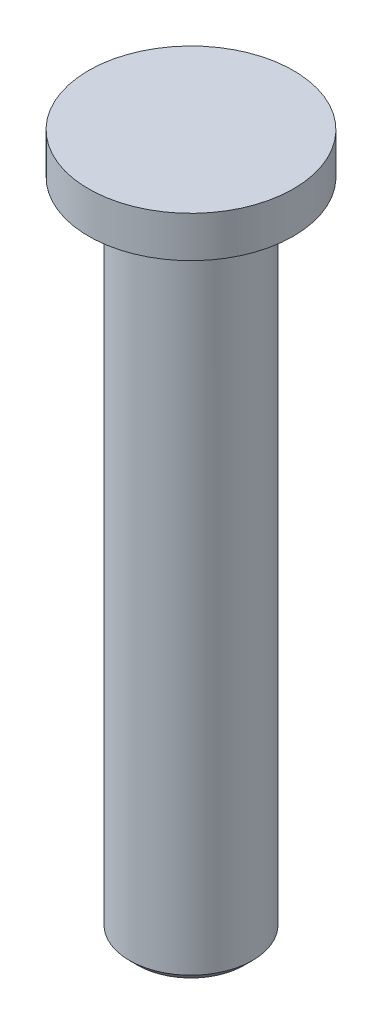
ISO-10303-21;
HEADER;
FILE_DESCRIPTION(('STEP AP214'),'2;1');
FILE_NAME('part.step','',(''),(''),'','','');
FILE_SCHEMA(('AUTOMOTIVE_DESIGN { 1 0 10303 214 1 1 1 1 }'));
ENDSEC;
DATA;
#1=APPLICATION_CONTEXT('core data for automotive mechanical design processes');
#2=APPLICATION_PROTOCOL_DEFINITION('international standard','automotive_design',2000,#1);
#3=PRODUCT_CONTEXT('',#1,'mechanical');
#4=PRODUCT('Part','Part','',(#3));
#5=PRODUCT_RELATED_PRODUCT_CATEGORY('part','',(#4));
#6=PRODUCT_DEFINITION_FORMATION('','',#4);
#7=PRODUCT_DEFINITION_CONTEXT('part definition',#1,'design');
#8=PRODUCT_DEFINITION('design','',#6,#7);
#9=PRODUCT_DEFINITION_SHAPE('','',#8);
#10=(LENGTH_UNIT() NAMED_UNIT(*) SI_UNIT(.MILLI.,.METRE.));
#11=(NAMED_UNIT(*) PLANE_ANGLE_UNIT() SI_UNIT($,.RADIAN.));
#12=(NAMED_UNIT(*) SI_UNIT($,.STERADIAN.) SOLID_ANGLE_UNIT());
#13=UNCERTAINTY_MEASURE_WITH_UNIT(LENGTH_MEASURE(1.E-05),#10,'distance_accuracy_value','');
#14=(GEOMETRIC_REPRESENTATION_CONTEXT(3) GLOBAL_UNCERTAINTY_ASSIGNED_CONTEXT((#13)) GLOBAL_UNIT_ASSIGNED_CONTEXT((#10,
#11,#12)) REPRESENTATION_CONTEXT('',''));
#15=CARTESIAN_POINT('',(0.,0.,0.));
#16=DIRECTION('',(0.,0.,1.));
#17=DIRECTION('',(1.,0.,0.));
#18=AXIS2_PLACEMENT_3D('',#15,#16,#17);
#19=CARTESIAN_POINT('',(1.25,3.93790076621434,0.));
#20=DIRECTION('',(0.,1.,0.));
#21=DIRECTION('',(0.,0.,1.));
#22=AXIS2_PLACEMENT_3D('',#19,#20,#21);
#23=PLANE('',#22);
#24=CARTESIAN_POINT('',(0.,3.93790076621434,0.));
#25=DIRECTION('',(0.,-1.,0.));
#26=DIRECTION('',(1.,0.,0.));
#27=AXIS2_PLACEMENT_3D('',#24,#25,#26);
#28=CIRCLE('',#27,2.5);
#29=CARTESIAN_POINT('',(2.5,3.93790076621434,0.));
#30=VERTEX_POINT('',#29);
#31=EDGE_CURVE('E17',#30,#30,#28,.T.);
#32=ORIENTED_EDGE('',*,*,#31,.F.);
#33=EDGE_LOOP('',(#32));
#34=FACE_BOUND('',#33,.T.);
#35=ADVANCED_FACE('F13',(#34),#23,.T.);
#36=CARTESIAN_POINT('',(0.,3.43790076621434,0.));
#37=DIRECTION('',(0.,-1.,0.));
#38=DIRECTION('',(1.,0.,0.));
#39=AXIS2_PLACEMENT_3D('',#36,#37,#38);
#40=CYLINDRICAL_SURFACE('',#39,2.5);
#41=ORIENTED_EDGE('',*,*,#31,.T.);
#42=EDGE_LOOP('',(#41));
#43=FACE_BOUND('',#42,.T.);
#44=CARTESIAN_POINT('',(0.,2.93790076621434,0.));
#45=DIRECTION('',(0.,-1.,0.));
#46=DIRECTION('',(1.,0.,0.));
#47=AXIS2_PLACEMENT_3D('',#44,#45,#46);
#48=CIRCLE('',#47,2.5);
#49=CARTESIAN_POINT('',(2.5,2.93790076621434,0.));
#50=VERTEX_POINT('',#49);
#51=EDGE_CURVE('E32',#50,#50,#48,.T.);
#52=ORIENTED_EDGE('',*,*,#51,.F.);
#53=EDGE_LOOP('',(#52));
#54=FACE_BOUND('',#53,.T.);
#55=ADVANCED_FACE('F39',(#43,#54),#40,.T.);
#56=CARTESIAN_POINT('',(0.750000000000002,-13.0620992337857,0.));
#57=DIRECTION('',(0.,-1.,0.));
#58=DIRECTION('',(0.,0.,-1.));
#59=AXIS2_PLACEMENT_3D('',#56,#57,#58);
#60=PLANE('',#59);
#61=CARTESIAN_POINT('',(0.,-13.0620992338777,0.));
#62=DIRECTION('',(0.,1.,0.));
#63=DIRECTION('',(0.,0.,1.));
#64=AXIS2_PLACEMENT_3D('',#61,#62,#63);
#65=CIRCLE('',#64,1.30000000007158);
#66=CARTESIAN_POINT('',(0.,-13.0620992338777,1.30000000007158));
#67=VERTEX_POINT('',#66);
#68=EDGE_CURVE('E26',#67,#67,#65,.T.);
#69=ORIENTED_EDGE('',*,*,#68,.F.);
#70=EDGE_LOOP('',(#69));
#71=FACE_BOUND('',#70,.T.);
#72=ADVANCED_FACE('F48',(#71),#60,.T.);
#73=CARTESIAN_POINT('',(2.,2.93790076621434,0.));
#74=DIRECTION('',(0.,-1.,0.));
#75=DIRECTION('',(0.,0.,-1.));
#76=AXIS2_PLACEMENT_3D('',#73,#74,#75);
#77=PLANE('',#76);
#78=CARTESIAN_POINT('',(0.,2.93790076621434,0.));
#79=DIRECTION('',(0.,-1.,0.));
#80=DIRECTION('',(1.,0.,0.));
#81=AXIS2_PLACEMENT_3D('',#78,#79,#80);
#82=CIRCLE('',#81,1.5);
#83=CARTESIAN_POINT('',(1.5,2.93790076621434,0.));
#84=VERTEX_POINT('',#83);
#85=EDGE_CURVE('E21',#84,#84,#82,.T.);
#86=ORIENTED_EDGE('',*,*,#85,.F.);
#87=EDGE_LOOP('',(#86));
#88=FACE_BOUND('',#87,.T.);
#89=ORIENTED_EDGE('',*,*,#51,.T.);
#90=EDGE_LOOP('',(#89));
#91=FACE_BOUND('',#90,.T.);
#92=ADVANCED_FACE('F55',(#88,#91),#77,.T.);
#93=CARTESIAN_POINT('',(0.,-12.8620992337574,0.));
#94=DIRECTION('',(0.,1.,0.));
#95=DIRECTION('',(0.,0.,1.));
#96=AXIS2_PLACEMENT_3D('',#93,#94,#95);
#97=CONICAL_SURFACE('',#96,1.49999999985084,0.785398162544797);
#98=ORIENTED_EDGE('',*,*,#68,.T.);
#99=EDGE_LOOP('',(#98));
#100=FACE_BOUND('',#99,.T.);
#101=CARTESIAN_POINT('',(0.,-12.8620992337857,0.));
#102=DIRECTION('',(0.,-1.,0.));
#103=DIRECTION('',(1.,0.,0.));
#104=AXIS2_PLACEMENT_3D('',#101,#102,#103);
#105=CIRCLE('',#104,1.5);
#106=CARTESIAN_POINT('',(1.5,-12.8620992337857,0.));
#107=VERTEX_POINT('',#106);
#108=EDGE_CURVE('E9',#107,#107,#105,.F.);
#109=ORIENTED_EDGE('',*,*,#108,.F.);
#110=EDGE_LOOP('',(#109));
#111=FACE_BOUND('',#110,.T.);
#112=ADVANCED_FACE('F51',(#100,#111),#97,.T.);
#113=CARTESIAN_POINT('',(0.,-5.06209923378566,0.));
#114=DIRECTION('',(0.,-1.,0.));
#115=DIRECTION('',(1.,0.,0.));
#116=AXIS2_PLACEMENT_3D('',#113,#114,#115);
#117=CYLINDRICAL_SURFACE('',#116,1.5);
#118=ORIENTED_EDGE('',*,*,#108,.T.);
#119=EDGE_LOOP('',(#118));
#120=FACE_BOUND('',#119,.T.);
#121=ORIENTED_EDGE('',*,*,#85,.T.);
#122=EDGE_LOOP('',(#121));
#123=FACE_BOUND('',#122,.T.);
#124=ADVANCED_FACE('F15',(#120,#123),#117,.T.);
#125=CLOSED_SHELL('',(#35,#55,#72,#92,#112,#124));
#126=MANIFOLD_SOLID_BREP('B1',#125);
#127=ADVANCED_BREP_SHAPE_REPRESENTATION('',(#18,#126),#14);
#128=SHAPE_DEFINITION_REPRESENTATION(#9,#127);
ENDSEC;
END-ISO-10303-21;
